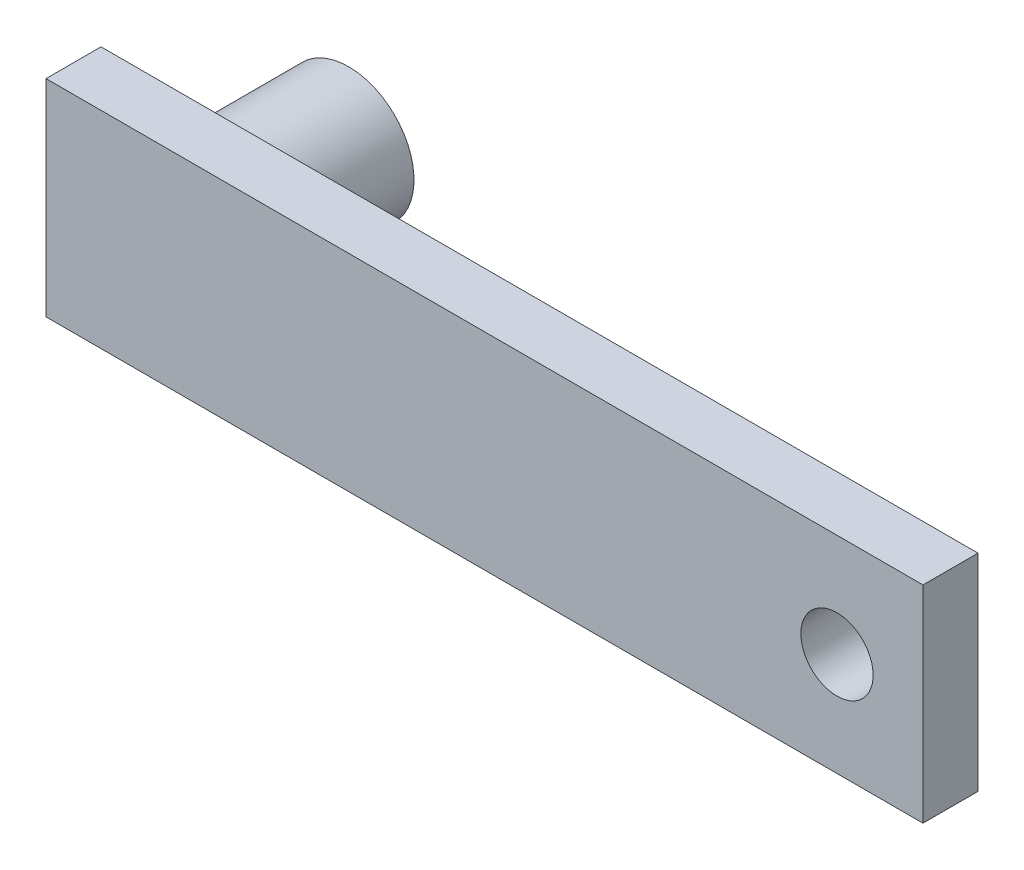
ISO-10303-21;
HEADER;
FILE_DESCRIPTION(('STEP AP214'),'2;1');
FILE_NAME('part.step','',(''),(''),'','','');
FILE_SCHEMA(('AUTOMOTIVE_DESIGN { 1 0 10303 214 1 1 1 1 }'));
ENDSEC;
DATA;
#1=APPLICATION_CONTEXT('core data for automotive mechanical design processes');
#2=APPLICATION_PROTOCOL_DEFINITION('international standard','automotive_design',2000,#1);
#3=PRODUCT_CONTEXT('',#1,'mechanical');
#4=PRODUCT('Part','Part','',(#3));
#5=PRODUCT_RELATED_PRODUCT_CATEGORY('part','',(#4));
#6=PRODUCT_DEFINITION_FORMATION('','',#4);
#7=PRODUCT_DEFINITION_CONTEXT('part definition',#1,'design');
#8=PRODUCT_DEFINITION('design','',#6,#7);
#9=PRODUCT_DEFINITION_SHAPE('','',#8);
#10=(LENGTH_UNIT() NAMED_UNIT(*) SI_UNIT(.MILLI.,.METRE.));
#11=(NAMED_UNIT(*) PLANE_ANGLE_UNIT() SI_UNIT($,.RADIAN.));
#12=(NAMED_UNIT(*) SI_UNIT($,.STERADIAN.) SOLID_ANGLE_UNIT());
#13=UNCERTAINTY_MEASURE_WITH_UNIT(LENGTH_MEASURE(1.E-05),#10,'distance_accuracy_value','');
#14=(GEOMETRIC_REPRESENTATION_CONTEXT(3) GLOBAL_UNCERTAINTY_ASSIGNED_CONTEXT((#13)) GLOBAL_UNIT_ASSIGNED_CONTEXT((#10,
#11,#12)) REPRESENTATION_CONTEXT('',''));
#15=CARTESIAN_POINT('',(0.,0.,0.));
#16=DIRECTION('',(0.,0.,1.));
#17=DIRECTION('',(1.,0.,0.));
#18=AXIS2_PLACEMENT_3D('',#15,#16,#17);
#19=CARTESIAN_POINT('',(9.5,9.5,21.));
#20=DIRECTION('',(0.,-1.,0.));
#21=DIRECTION('',(0.,0.,-1.));
#22=AXIS2_PLACEMENT_3D('',#19,#20,#21);
#23=PLANE('',#22);
#24=DIRECTION('',(-1.,0.,0.));
#25=VECTOR('',#24,1.);
#26=CARTESIAN_POINT('',(9.5,9.5,20.));
#27=LINE('',#26,#25);
#28=CARTESIAN_POINT('',(9.5,9.5,20.));
#29=VERTEX_POINT('',#28);
#30=CARTESIAN_POINT('',(0.,9.5,20.));
#31=VERTEX_POINT('',#30);
#32=EDGE_CURVE('E122',#29,#31,#27,.T.);
#33=ORIENTED_EDGE('',*,*,#32,.T.);
#34=DIRECTION('',(1.,0.,0.));
#35=VECTOR('',#34,1.);
#36=CARTESIAN_POINT('',(9.5,9.5,20.));
#37=LINE('',#36,#35);
#38=CARTESIAN_POINT('',(-9.5,9.5,20.));
#39=VERTEX_POINT('',#38);
#40=EDGE_CURVE('E105',#39,#31,#37,.T.);
#41=ORIENTED_EDGE('',*,*,#40,.F.);
#42=DIRECTION('',(0.,0.,-1.));
#43=VECTOR('',#42,1.);
#44=CARTESIAN_POINT('',(-9.5,9.5,21.));
#45=LINE('',#44,#43);
#46=CARTESIAN_POINT('',(-9.5,9.5,21.));
#47=VERTEX_POINT('',#46);
#48=EDGE_CURVE('E9',#47,#39,#45,.T.);
#49=ORIENTED_EDGE('',*,*,#48,.F.);
#50=DIRECTION('',(-1.,0.,0.));
#51=VECTOR('',#50,1.);
#52=CARTESIAN_POINT('',(9.5,9.5,21.));
#53=LINE('',#52,#51);
#54=CARTESIAN_POINT('',(9.5,9.5,21.));
#55=VERTEX_POINT('',#54);
#56=EDGE_CURVE('E132',#55,#47,#53,.T.);
#57=ORIENTED_EDGE('',*,*,#56,.F.);
#58=DIRECTION('',(0.,0.,-1.));
#59=VECTOR('',#58,1.);
#60=CARTESIAN_POINT('',(9.5,9.5,21.));
#61=LINE('',#60,#59);
#62=EDGE_CURVE('E133',#55,#29,#61,.T.);
#63=ORIENTED_EDGE('',*,*,#62,.T.);
#64=EDGE_LOOP('',(#33,#41,#49,#57,#63));
#65=FACE_BOUND('',#64,.T.);
#66=ADVANCED_FACE('F14',(#65),#23,.F.);
#67=CARTESIAN_POINT('',(-9.5,9.5,21.));
#68=DIRECTION('',(1.,0.,0.));
#69=DIRECTION('',(0.,0.,1.));
#70=AXIS2_PLACEMENT_3D('',#67,#68,#69);
#71=PLANE('',#70);
#72=DIRECTION('',(0.,-1.,0.));
#73=VECTOR('',#72,1.);
#74=CARTESIAN_POINT('',(-9.5,9.5,20.));
#75=LINE('',#74,#73);
#76=CARTESIAN_POINT('',(-9.5,0.,20.));
#77=VERTEX_POINT('',#76);
#78=EDGE_CURVE('E117',#39,#77,#75,.T.);
#79=ORIENTED_EDGE('',*,*,#78,.T.);
#80=DIRECTION('',(0.,1.,0.));
#81=VECTOR('',#80,1.);
#82=CARTESIAN_POINT('',(-9.5,9.5,20.));
#83=LINE('',#82,#81);
#84=CARTESIAN_POINT('',(-9.5,-9.5,20.));
#85=VERTEX_POINT('',#84);
#86=EDGE_CURVE('E95',#85,#77,#83,.T.);
#87=ORIENTED_EDGE('',*,*,#86,.F.);
#88=DIRECTION('',(0.,0.,-1.));
#89=VECTOR('',#88,1.);
#90=CARTESIAN_POINT('',(-9.5,-9.5,21.));
#91=LINE('',#90,#89);
#92=CARTESIAN_POINT('',(-9.5,-9.5,21.));
#93=VERTEX_POINT('',#92);
#94=EDGE_CURVE('E22',#93,#85,#91,.T.);
#95=ORIENTED_EDGE('',*,*,#94,.F.);
#96=DIRECTION('',(0.,-1.,0.));
#97=VECTOR('',#96,1.);
#98=CARTESIAN_POINT('',(-9.5,9.5,21.));
#99=LINE('',#98,#97);
#100=EDGE_CURVE('E142',#47,#93,#99,.T.);
#101=ORIENTED_EDGE('',*,*,#100,.F.);
#102=ORIENTED_EDGE('',*,*,#48,.T.);
#103=EDGE_LOOP('',(#79,#87,#95,#101,#102));
#104=FACE_BOUND('',#103,.T.);
#105=ADVANCED_FACE('F120',(#104),#71,.F.);
#106=CARTESIAN_POINT('',(9.5,-9.5,21.));
#107=DIRECTION('',(0.,1.,0.));
#108=DIRECTION('',(-1.,0.,0.));
#109=AXIS2_PLACEMENT_3D('',#106,#107,#108);
#110=PLANE('',#109);
#111=DIRECTION('',(1.,0.,0.));
#112=VECTOR('',#111,1.);
#113=CARTESIAN_POINT('',(9.5,-9.5,20.));
#114=LINE('',#113,#112);
#115=CARTESIAN_POINT('',(0.,-9.5,20.));
#116=VERTEX_POINT('',#115);
#117=EDGE_CURVE('E100',#85,#116,#114,.T.);
#118=ORIENTED_EDGE('',*,*,#117,.T.);
#119=DIRECTION('',(-1.,0.,0.));
#120=VECTOR('',#119,1.);
#121=CARTESIAN_POINT('',(9.5,-9.5,20.));
#122=LINE('',#121,#120);
#123=CARTESIAN_POINT('',(9.5,-9.5,20.));
#124=VERTEX_POINT('',#123);
#125=EDGE_CURVE('E185',#124,#116,#122,.T.);
#126=ORIENTED_EDGE('',*,*,#125,.F.);
#127=DIRECTION('',(0.,0.,-1.));
#128=VECTOR('',#127,1.);
#129=CARTESIAN_POINT('',(9.5,-9.5,21.));
#130=LINE('',#129,#128);
#131=CARTESIAN_POINT('',(9.5,-9.5,21.));
#132=VERTEX_POINT('',#131);
#133=EDGE_CURVE('E37',#132,#124,#130,.T.);
#134=ORIENTED_EDGE('',*,*,#133,.F.);
#135=DIRECTION('',(1.,0.,0.));
#136=VECTOR('',#135,1.);
#137=CARTESIAN_POINT('',(9.5,-9.5,21.));
#138=LINE('',#137,#136);
#139=EDGE_CURVE('E140',#93,#132,#138,.T.);
#140=ORIENTED_EDGE('',*,*,#139,.F.);
#141=ORIENTED_EDGE('',*,*,#94,.T.);
#142=EDGE_LOOP('',(#118,#126,#134,#140,#141));
#143=FACE_BOUND('',#142,.T.);
#144=ADVANCED_FACE('F138',(#143),#110,.F.);
#145=CARTESIAN_POINT('',(9.5,9.5,21.));
#146=DIRECTION('',(-1.,0.,0.));
#147=DIRECTION('',(0.,-1.,0.));
#148=AXIS2_PLACEMENT_3D('',#145,#146,#147);
#149=PLANE('',#148);
#150=DIRECTION('',(0.,1.,0.));
#151=VECTOR('',#150,1.);
#152=CARTESIAN_POINT('',(9.5,9.5,20.));
#153=LINE('',#152,#151);
#154=CARTESIAN_POINT('',(9.5,0.,20.));
#155=VERTEX_POINT('',#154);
#156=EDGE_CURVE('E124',#124,#155,#153,.T.);
#157=ORIENTED_EDGE('',*,*,#156,.T.);
#158=DIRECTION('',(0.,-1.,0.));
#159=VECTOR('',#158,1.);
#160=CARTESIAN_POINT('',(9.5,9.5,20.));
#161=LINE('',#160,#159);
#162=EDGE_CURVE('E119',#29,#155,#161,.T.);
#163=ORIENTED_EDGE('',*,*,#162,.F.);
#164=ORIENTED_EDGE('',*,*,#62,.F.);
#165=DIRECTION('',(0.,1.,0.));
#166=VECTOR('',#165,1.);
#167=CARTESIAN_POINT('',(9.5,9.5,21.));
#168=LINE('',#167,#166);
#169=EDGE_CURVE('E136',#132,#55,#168,.T.);
#170=ORIENTED_EDGE('',*,*,#169,.F.);
#171=ORIENTED_EDGE('',*,*,#133,.T.);
#172=EDGE_LOOP('',(#157,#163,#164,#170,#171));
#173=FACE_BOUND('',#172,.T.);
#174=ADVANCED_FACE('F215',(#173),#149,.F.);
#175=CARTESIAN_POINT('',(-15.,15.,21.));
#176=DIRECTION('',(0.,0.,1.));
#177=DIRECTION('',(0.,-1.,0.));
#178=AXIS2_PLACEMENT_3D('',#175,#176,#177);
#179=PLANE('',#178);
#180=CARTESIAN_POINT('',(100.,0.,21.));
#181=DIRECTION('',(0.,0.,1.));
#182=DIRECTION('',(0.,-1.,0.));
#183=AXIS2_PLACEMENT_3D('',#180,#181,#182);
#184=CIRCLE('',#183,5.25);
#185=CARTESIAN_POINT('',(100.,-5.25,21.));
#186=VERTEX_POINT('',#185);
#187=EDGE_CURVE('E17',#186,#186,#184,.T.);
#188=ORIENTED_EDGE('',*,*,#187,.T.);
#189=EDGE_LOOP('',(#188));
#190=FACE_BOUND('',#189,.T.);
#191=DIRECTION('',(-1.,0.,0.));
#192=VECTOR('',#191,1.);
#193=CARTESIAN_POINT('',(112.5,15.,21.));
#194=LINE('',#193,#192);
#195=CARTESIAN_POINT('',(112.5,15.,21.));
#196=VERTEX_POINT('',#195);
#197=CARTESIAN_POINT('',(-15.,15.,21.));
#198=VERTEX_POINT('',#197);
#199=EDGE_CURVE('E172',#196,#198,#194,.T.);
#200=ORIENTED_EDGE('',*,*,#199,.F.);
#201=DIRECTION('',(0.,1.,0.));
#202=VECTOR('',#201,1.);
#203=CARTESIAN_POINT('',(112.5,15.,21.));
#204=LINE('',#203,#202);
#205=CARTESIAN_POINT('',(112.5,-15.,21.));
#206=VERTEX_POINT('',#205);
#207=EDGE_CURVE('E165',#206,#196,#204,.T.);
#208=ORIENTED_EDGE('',*,*,#207,.F.);
#209=DIRECTION('',(1.,0.,0.));
#210=VECTOR('',#209,1.);
#211=CARTESIAN_POINT('',(112.5,-15.,21.));
#212=LINE('',#211,#210);
#213=CARTESIAN_POINT('',(-15.,-15.,21.));
#214=VERTEX_POINT('',#213);
#215=EDGE_CURVE('E168',#214,#206,#212,.T.);
#216=ORIENTED_EDGE('',*,*,#215,.F.);
#217=DIRECTION('',(0.,-1.,0.));
#218=VECTOR('',#217,1.);
#219=CARTESIAN_POINT('',(-15.,15.,21.));
#220=LINE('',#219,#218);
#221=EDGE_CURVE('E170',#198,#214,#220,.T.);
#222=ORIENTED_EDGE('',*,*,#221,.F.);
#223=EDGE_LOOP('',(#200,#208,#216,#222));
#224=FACE_BOUND('',#223,.T.);
#225=ORIENTED_EDGE('',*,*,#169,.T.);
#226=ORIENTED_EDGE('',*,*,#56,.T.);
#227=ORIENTED_EDGE('',*,*,#100,.T.);
#228=ORIENTED_EDGE('',*,*,#139,.T.);
#229=EDGE_LOOP('',(#225,#226,#227,#228));
#230=FACE_BOUND('',#229,.T.);
#231=ADVANCED_FACE('F149',(#190,#224,#230),#179,.F.);
#232=CARTESIAN_POINT('',(112.5,15.,29.));
#233=DIRECTION('',(0.,-1.,0.));
#234=DIRECTION('',(1.,0.,0.));
#235=AXIS2_PLACEMENT_3D('',#232,#233,#234);
#236=PLANE('',#235);
#237=ORIENTED_EDGE('',*,*,#199,.T.);
#238=DIRECTION('',(0.,0.,-1.));
#239=VECTOR('',#238,1.);
#240=CARTESIAN_POINT('',(-15.,15.,29.));
#241=LINE('',#240,#239);
#242=CARTESIAN_POINT('',(-15.,15.,29.));
#243=VERTEX_POINT('',#242);
#244=EDGE_CURVE('E126',#243,#198,#241,.T.);
#245=ORIENTED_EDGE('',*,*,#244,.F.);
#246=DIRECTION('',(-1.,0.,0.));
#247=VECTOR('',#246,1.);
#248=CARTESIAN_POINT('',(112.5,15.,29.));
#249=LINE('',#248,#247);
#250=CARTESIAN_POINT('',(112.5,15.,29.));
#251=VERTEX_POINT('',#250);
#252=EDGE_CURVE('E167',#251,#243,#249,.T.);
#253=ORIENTED_EDGE('',*,*,#252,.F.);
#254=DIRECTION('',(0.,0.,-1.));
#255=VECTOR('',#254,1.);
#256=CARTESIAN_POINT('',(112.5,15.,29.));
#257=LINE('',#256,#255);
#258=EDGE_CURVE('E161',#251,#196,#257,.T.);
#259=ORIENTED_EDGE('',*,*,#258,.T.);
#260=EDGE_LOOP('',(#237,#245,#253,#259));
#261=FACE_BOUND('',#260,.T.);
#262=ADVANCED_FACE('F221',(#261),#236,.F.);
#263=CARTESIAN_POINT('',(-15.,15.,29.));
#264=DIRECTION('',(1.,0.,0.));
#265=DIRECTION('',(0.,1.,0.));
#266=AXIS2_PLACEMENT_3D('',#263,#264,#265);
#267=PLANE('',#266);
#268=ORIENTED_EDGE('',*,*,#221,.T.);
#269=DIRECTION('',(0.,0.,-1.));
#270=VECTOR('',#269,1.);
#271=CARTESIAN_POINT('',(-15.,-15.,29.));
#272=LINE('',#271,#270);
#273=CARTESIAN_POINT('',(-15.,-15.,29.));
#274=VERTEX_POINT('',#273);
#275=EDGE_CURVE('E155',#274,#214,#272,.T.);
#276=ORIENTED_EDGE('',*,*,#275,.F.);
#277=DIRECTION('',(0.,-1.,0.));
#278=VECTOR('',#277,1.);
#279=CARTESIAN_POINT('',(-15.,15.,29.));
#280=LINE('',#279,#278);
#281=EDGE_CURVE('E178',#243,#274,#280,.T.);
#282=ORIENTED_EDGE('',*,*,#281,.F.);
#283=ORIENTED_EDGE('',*,*,#244,.T.);
#284=EDGE_LOOP('',(#268,#276,#282,#283));
#285=FACE_BOUND('',#284,.T.);
#286=ADVANCED_FACE('F224',(#285),#267,.F.);
#287=CARTESIAN_POINT('',(112.5,-15.,29.));
#288=DIRECTION('',(0.,1.,0.));
#289=DIRECTION('',(-1.,0.,0.));
#290=AXIS2_PLACEMENT_3D('',#287,#288,#289);
#291=PLANE('',#290);
#292=ORIENTED_EDGE('',*,*,#215,.T.);
#293=DIRECTION('',(0.,0.,-1.));
#294=VECTOR('',#293,1.);
#295=CARTESIAN_POINT('',(112.5,-15.,29.));
#296=LINE('',#295,#294);
#297=CARTESIAN_POINT('',(112.5,-15.,29.));
#298=VERTEX_POINT('',#297);
#299=EDGE_CURVE('E158',#298,#206,#296,.T.);
#300=ORIENTED_EDGE('',*,*,#299,.F.);
#301=DIRECTION('',(1.,0.,0.));
#302=VECTOR('',#301,1.);
#303=CARTESIAN_POINT('',(112.5,-15.,29.));
#304=LINE('',#303,#302);
#305=EDGE_CURVE('E176',#274,#298,#304,.T.);
#306=ORIENTED_EDGE('',*,*,#305,.F.);
#307=ORIENTED_EDGE('',*,*,#275,.T.);
#308=EDGE_LOOP('',(#292,#300,#306,#307));
#309=FACE_BOUND('',#308,.T.);
#310=ADVANCED_FACE('F228',(#309),#291,.F.);
#311=CARTESIAN_POINT('',(112.5,15.,29.));
#312=DIRECTION('',(-1.,0.,0.));
#313=DIRECTION('',(0.,0.,-1.));
#314=AXIS2_PLACEMENT_3D('',#311,#312,#313);
#315=PLANE('',#314);
#316=ORIENTED_EDGE('',*,*,#207,.T.);
#317=ORIENTED_EDGE('',*,*,#258,.F.);
#318=DIRECTION('',(0.,1.,0.));
#319=VECTOR('',#318,1.);
#320=CARTESIAN_POINT('',(112.5,15.,29.));
#321=LINE('',#320,#319);
#322=EDGE_CURVE('E164',#298,#251,#321,.T.);
#323=ORIENTED_EDGE('',*,*,#322,.F.);
#324=ORIENTED_EDGE('',*,*,#299,.T.);
#325=EDGE_LOOP('',(#316,#317,#323,#324));
#326=FACE_BOUND('',#325,.T.);
#327=ADVANCED_FACE('F232',(#326),#315,.F.);
#328=CARTESIAN_POINT('',(-15.,15.,29.));
#329=DIRECTION('',(0.,0.,1.));
#330=DIRECTION('',(0.,-1.,0.));
#331=AXIS2_PLACEMENT_3D('',#328,#329,#330);
#332=PLANE('',#331);
#333=CARTESIAN_POINT('',(100.,0.,29.));
#334=DIRECTION('',(0.,0.,1.));
#335=DIRECTION('',(0.,-1.,0.));
#336=AXIS2_PLACEMENT_3D('',#333,#334,#335);
#337=CIRCLE('',#336,5.25);
#338=CARTESIAN_POINT('',(100.,-5.25,29.));
#339=VERTEX_POINT('',#338);
#340=EDGE_CURVE('E104',#339,#339,#337,.T.);
#341=ORIENTED_EDGE('',*,*,#340,.F.);
#342=EDGE_LOOP('',(#341));
#343=FACE_BOUND('',#342,.T.);
#344=ORIENTED_EDGE('',*,*,#252,.T.);
#345=ORIENTED_EDGE('',*,*,#281,.T.);
#346=ORIENTED_EDGE('',*,*,#305,.T.);
#347=ORIENTED_EDGE('',*,*,#322,.T.);
#348=EDGE_LOOP('',(#344,#345,#346,#347));
#349=FACE_BOUND('',#348,.T.);
#350=ADVANCED_FACE('F236',(#343,#349),#332,.T.);
#351=CARTESIAN_POINT('',(100.,0.,29.));
#352=DIRECTION('',(0.,0.,1.));
#353=DIRECTION('',(0.,-1.,0.));
#354=AXIS2_PLACEMENT_3D('',#351,#352,#353);
#355=CYLINDRICAL_SURFACE('',#354,5.25);
#356=ORIENTED_EDGE('',*,*,#340,.T.);
#357=EDGE_LOOP('',(#356));
#358=FACE_BOUND('',#357,.T.);
#359=ORIENTED_EDGE('',*,*,#187,.F.);
#360=EDGE_LOOP('',(#359));
#361=FACE_BOUND('',#360,.T.);
#362=ADVANCED_FACE('F243',(#358,#361),#355,.F.);
#363=CARTESIAN_POINT('',(0.,0.,20.));
#364=DIRECTION('',(0.,0.,-1.));
#365=DIRECTION('',(-1.,0.,0.));
#366=AXIS2_PLACEMENT_3D('',#363,#364,#365);
#367=PLANE('',#366);
#368=ORIENTED_EDGE('',*,*,#86,.T.);
#369=CARTESIAN_POINT('',(0.,0.,20.));
#370=DIRECTION('',(0.,0.,-1.));
#371=DIRECTION('',(-1.,0.,0.));
#372=AXIS2_PLACEMENT_3D('',#369,#370,#371);
#373=CIRCLE('',#372,9.5);
#374=EDGE_CURVE('E98',#116,#77,#373,.T.);
#375=ORIENTED_EDGE('',*,*,#374,.F.);
#376=ORIENTED_EDGE('',*,*,#117,.F.);
#377=EDGE_LOOP('',(#368,#375,#376));
#378=FACE_BOUND('',#377,.T.);
#379=ADVANCED_FACE('F97',(#378),#367,.T.);
#380=ORIENTED_EDGE('',*,*,#78,.F.);
#381=ORIENTED_EDGE('',*,*,#40,.T.);
#382=EDGE_CURVE('E110',#77,#31,#373,.T.);
#383=ORIENTED_EDGE('',*,*,#382,.F.);
#384=EDGE_LOOP('',(#380,#381,#383));
#385=FACE_BOUND('',#384,.T.);
#386=ADVANCED_FACE('F116',(#385),#367,.T.);
#387=ORIENTED_EDGE('',*,*,#32,.F.);
#388=ORIENTED_EDGE('',*,*,#162,.T.);
#389=EDGE_CURVE('E29',#31,#155,#373,.T.);
#390=ORIENTED_EDGE('',*,*,#389,.F.);
#391=EDGE_LOOP('',(#387,#388,#390));
#392=FACE_BOUND('',#391,.T.);
#393=ADVANCED_FACE('F203',(#392),#367,.T.);
#394=ORIENTED_EDGE('',*,*,#125,.T.);
#395=EDGE_CURVE('E112',#155,#116,#373,.T.);
#396=ORIENTED_EDGE('',*,*,#395,.F.);
#397=ORIENTED_EDGE('',*,*,#156,.F.);
#398=EDGE_LOOP('',(#394,#396,#397));
#399=FACE_BOUND('',#398,.T.);
#400=ADVANCED_FACE('F194',(#399),#367,.T.);
#401=CARTESIAN_POINT('',(0.,0.,20.));
#402=DIRECTION('',(0.,0.,-1.));
#403=DIRECTION('',(-1.,0.,0.));
#404=AXIS2_PLACEMENT_3D('',#401,#402,#403);
#405=CYLINDRICAL_SURFACE('',#404,9.5);
#406=ORIENTED_EDGE('',*,*,#382,.T.);
#407=ORIENTED_EDGE('',*,*,#389,.T.);
#408=ORIENTED_EDGE('',*,*,#395,.T.);
#409=ORIENTED_EDGE('',*,*,#374,.T.);
#410=EDGE_LOOP('',(#406,#407,#408,#409));
#411=FACE_BOUND('',#410,.T.);
#412=CARTESIAN_POINT('',(0.,0.,0.));
#413=DIRECTION('',(0.,0.,-1.));
#414=DIRECTION('',(-1.,0.,0.));
#415=AXIS2_PLACEMENT_3D('',#412,#413,#414);
#416=CIRCLE('',#415,9.5);
#417=CARTESIAN_POINT('',(-9.5,0.,0.));
#418=VERTEX_POINT('',#417);
#419=EDGE_CURVE('E113',#418,#418,#416,.T.);
#420=ORIENTED_EDGE('',*,*,#419,.F.);
#421=EDGE_LOOP('',(#420));
#422=FACE_BOUND('',#421,.T.);
#423=ADVANCED_FACE('F108',(#411,#422),#405,.T.);
#424=CARTESIAN_POINT('',(0.,0.,0.));
#425=DIRECTION('',(0.,0.,1.));
#426=DIRECTION('',(1.,0.,0.));
#427=AXIS2_PLACEMENT_3D('',#424,#425,#426);
#428=PLANE('',#427);
#429=ORIENTED_EDGE('',*,*,#419,.T.);
#430=EDGE_LOOP('',(#429));
#431=FACE_BOUND('',#430,.T.);
#432=ADVANCED_FACE('F192',(#431),#428,.F.);
#433=CLOSED_SHELL('',(#66,#105,#144,#174,#231,#262,#286,#310,#327,#350,#362,#379,#386,#393,#400,
#423,#432));
#434=MANIFOLD_SOLID_BREP('B1',#433);
#435=ADVANCED_BREP_SHAPE_REPRESENTATION('',(#18,#434),#14);
#436=SHAPE_DEFINITION_REPRESENTATION(#9,#435);
ENDSEC;
END-ISO-10303-21;
